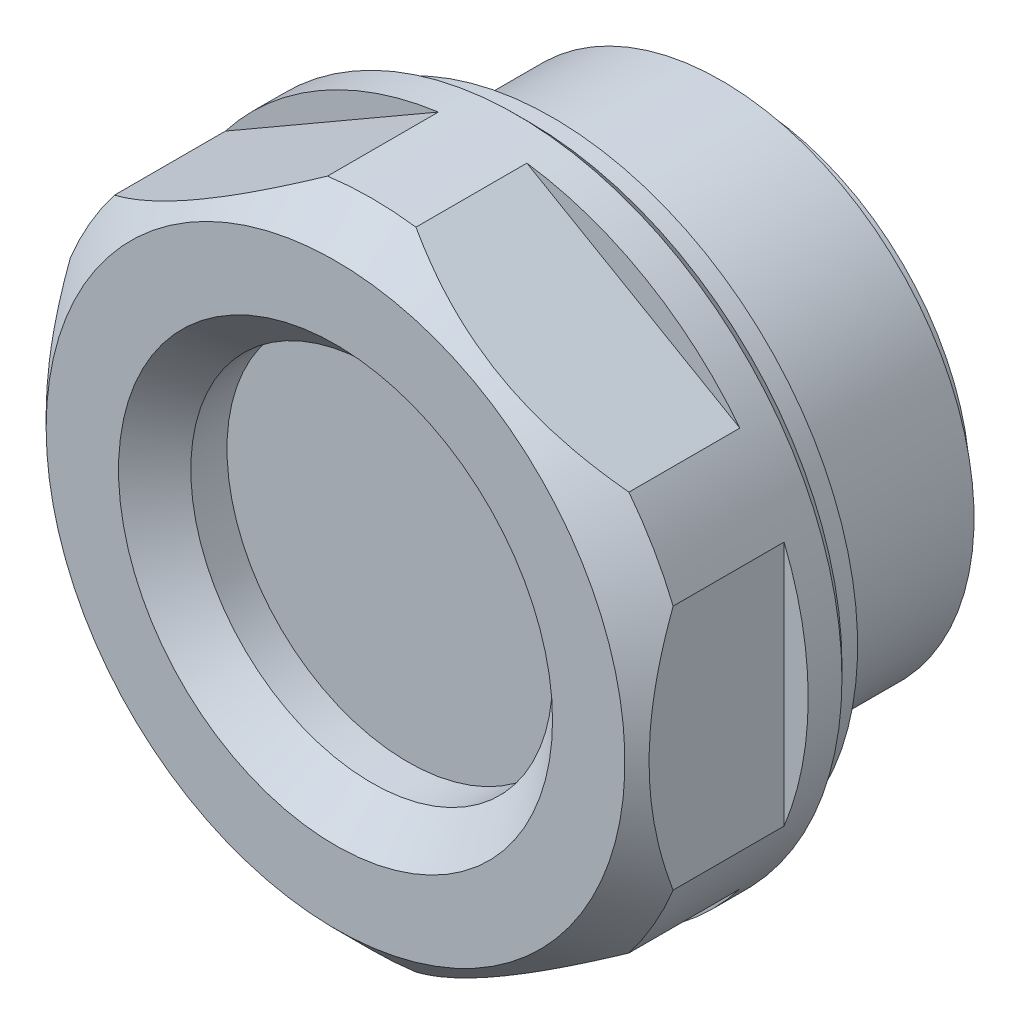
ISO-10303-21;
HEADER;
FILE_DESCRIPTION(('STEP AP214'),'2;1');
FILE_NAME('part.step','',(''),(''),'','','');
FILE_SCHEMA(('AUTOMOTIVE_DESIGN { 1 0 10303 214 1 1 1 1 }'));
ENDSEC;
DATA;
#1=APPLICATION_CONTEXT('core data for automotive mechanical design processes');
#2=APPLICATION_PROTOCOL_DEFINITION('international standard','automotive_design',2000,#1);
#3=PRODUCT_CONTEXT('',#1,'mechanical');
#4=PRODUCT('Part','Part','',(#3));
#5=PRODUCT_RELATED_PRODUCT_CATEGORY('part','',(#4));
#6=PRODUCT_DEFINITION_FORMATION('','',#4);
#7=PRODUCT_DEFINITION_CONTEXT('part definition',#1,'design');
#8=PRODUCT_DEFINITION('design','',#6,#7);
#9=PRODUCT_DEFINITION_SHAPE('','',#8);
#10=(LENGTH_UNIT() NAMED_UNIT(*) SI_UNIT(.MILLI.,.METRE.));
#11=(NAMED_UNIT(*) PLANE_ANGLE_UNIT() SI_UNIT($,.RADIAN.));
#12=(NAMED_UNIT(*) SI_UNIT($,.STERADIAN.) SOLID_ANGLE_UNIT());
#13=UNCERTAINTY_MEASURE_WITH_UNIT(LENGTH_MEASURE(1.E-05),#10,'distance_accuracy_value','');
#14=(GEOMETRIC_REPRESENTATION_CONTEXT(3) GLOBAL_UNCERTAINTY_ASSIGNED_CONTEXT((#13)) GLOBAL_UNIT_ASSIGNED_CONTEXT((#10,
#11,#12)) REPRESENTATION_CONTEXT('',''));
#15=CARTESIAN_POINT('',(0.,0.,0.));
#16=DIRECTION('',(0.,0.,1.));
#17=DIRECTION('',(1.,0.,0.));
#18=AXIS2_PLACEMENT_3D('',#15,#16,#17);
#19=CARTESIAN_POINT('',(-8.45677694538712E-13,-4.85722573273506E-13,7.5));
#20=DIRECTION('',(1.12757025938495E-13,0.,-1.));
#21=DIRECTION('',(-1.,0.,-1.12757025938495E-13));
#22=AXIS2_PLACEMENT_3D('',#19,#20,#21);
#23=CONICAL_SURFACE('',#22,13.5,0.78539816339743);
#24=CARTESIAN_POINT('',(-10.6660804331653,8.27569232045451,7.49991277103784));
#25=CARTESIAN_POINT('',(-10.4905943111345,8.37700928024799,7.57644782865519));
#26=CARTESIAN_POINT('',(-10.3139926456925,8.47897029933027,7.64956464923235));
#27=CARTESIAN_POINT('',(-9.95851789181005,8.68420374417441,7.78825873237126));
#28=CARTESIAN_POINT('',(-9.77964403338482,8.78747661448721,7.85383335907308));
#29=CARTESIAN_POINT('',(-9.23892063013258,9.09966341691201,8.0383908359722));
#30=CARTESIAN_POINT('',(-8.87376700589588,9.31048496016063,8.14485272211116));
#31=CARTESIAN_POINT('',(-8.14951864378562,9.72862994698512,8.31537622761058));
#32=CARTESIAN_POINT('',(-7.79067194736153,9.93581018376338,8.38081403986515));
#33=CARTESIAN_POINT('',(-7.24983830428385,10.2480606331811,8.44850810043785));
#34=CARTESIAN_POINT('',(-7.06921808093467,10.3523417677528,8.46599461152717));
#35=CARTESIAN_POINT('',(-6.70745476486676,10.5612059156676,8.49057927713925));
#36=CARTESIAN_POINT('',(-6.5263117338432,10.6657888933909,8.4976786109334));
#37=CARTESIAN_POINT('',(-6.15630803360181,10.8794106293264,8.50143364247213));
#38=CARTESIAN_POINT('',(-5.96744390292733,10.9884513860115,8.49763650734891));
#39=CARTESIAN_POINT('',(-5.59014251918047,11.2062864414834,8.47869087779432));
#40=CARTESIAN_POINT('',(-5.40170527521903,11.3150807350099,8.4635421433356));
#41=CARTESIAN_POINT('',(-5.02550053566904,11.5322826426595,8.42214651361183));
#42=CARTESIAN_POINT('',(-4.83773423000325,11.6406895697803,8.39588520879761));
#43=CARTESIAN_POINT('',(-4.46353816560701,11.8567317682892,8.33273814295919));
#44=CARTESIAN_POINT('',(-4.27710862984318,11.9643669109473,8.29585064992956));
#45=CARTESIAN_POINT('',(-3.70615459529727,12.2940073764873,8.1669143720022));
#46=CARTESIAN_POINT('',(-3.3243598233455,12.5144366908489,8.05822381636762));
#47=CARTESIAN_POINT('',(-2.7593850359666,12.8406250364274,7.86788171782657));
#48=CARTESIAN_POINT('',(-2.57256512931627,12.9484855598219,7.79998074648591));
#49=CARTESIAN_POINT('',(-2.20140446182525,13.1627752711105,7.65592899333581));
#50=CARTESIAN_POINT('',(-2.01706274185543,13.269205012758,7.57978151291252));
#51=CARTESIAN_POINT('',(-1.83391956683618,13.3749427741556,7.49991277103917));
#52=B_SPLINE_CURVE_WITH_KNOTS('',3,(#24,#25,#26,#27,#28,#29,#30,#31,#32,#33,#34,#35,#36,#37,#38,
#39,#40,#41,#42,#43,#44,#45,#46,#47,#48,#49,#50,#51),.UNSPECIFIED.,.F.,.F.,(4,2,2,2,2,2,2,2,2,2,
2,2,2,4),(0.,0.649767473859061,1.29976134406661,2.60270225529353,3.8591960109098,
4.48685708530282,5.11444689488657,5.76849079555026,6.42254852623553,7.07745697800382,
7.73247223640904,9.09240085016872,9.77074485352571,10.4488182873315),.UNSPECIFIED.);
#53=CARTESIAN_POINT('',(-10.6658804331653,8.27580779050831,7.49999999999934));
#54=VERTEX_POINT('',#53);
#55=CARTESIAN_POINT('',(-1.83411956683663,13.3748273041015,7.50000000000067));
#56=VERTEX_POINT('',#55);
#57=EDGE_CURVE('E168',#54,#56,#52,.T.);
#58=ORIENTED_EDGE('',*,*,#57,.F.);
#59=CARTESIAN_POINT('',(-8.45677694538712E-13,-4.85722573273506E-13,7.5));
#60=DIRECTION('',(1.12757025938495E-13,0.,-1.));
#61=DIRECTION('',(-1.,0.,-1.12757025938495E-13));
#62=AXIS2_PLACEMENT_3D('',#59,#60,#61);
#63=CIRCLE('',#62,13.5);
#64=CARTESIAN_POINT('',(-12.5000000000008,5.09901951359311,7.49999999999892));
#65=VERTEX_POINT('',#64);
#66=EDGE_CURVE('E149',#65,#54,#63,.T.);
#67=ORIENTED_EDGE('',*,*,#66,.F.);
#68=CARTESIAN_POINT('',(-12.5000000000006,-9.93363759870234,5.03356157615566));
#69=CARTESIAN_POINT('',(-12.5000000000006,-9.69388572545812,5.18270263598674));
#70=CARTESIAN_POINT('',(-12.5000000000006,-9.4526527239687,5.3294988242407));
#71=CARTESIAN_POINT('',(-12.5000000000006,-8.96688486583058,5.6176532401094));
#72=CARTESIAN_POINT('',(-12.5000000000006,-8.72234922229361,5.7590101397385));
#73=CARTESIAN_POINT('',(-12.5000000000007,-8.22868906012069,6.03606147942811));
#74=CARTESIAN_POINT('',(-12.5000000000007,-7.97954928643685,6.17172883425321));
#75=CARTESIAN_POINT('',(-12.5000000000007,-7.47745065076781,6.43577472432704));
#76=CARTESIAN_POINT('',(-12.5000000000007,-7.22449203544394,6.56415372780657));
#77=CARTESIAN_POINT('',(-12.5000000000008,-6.70890838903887,6.81523089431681));
#78=CARTESIAN_POINT('',(-12.5000000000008,-6.44619281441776,6.93774446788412));
#79=CARTESIAN_POINT('',(-12.5000000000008,-5.91627505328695,7.17264076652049));
#80=CARTESIAN_POINT('',(-12.5000000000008,-5.6490724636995,7.28502257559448));
#81=CARTESIAN_POINT('',(-12.5000000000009,-4.84136142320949,7.60430527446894));
#82=CARTESIAN_POINT('',(-12.5000000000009,-4.29368149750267,7.79387664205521));
#83=CARTESIAN_POINT('',(-12.5000000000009,-3.42588027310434,8.042471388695));
#84=CARTESIAN_POINT('',(-12.5000000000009,-3.11163501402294,8.12223899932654));
#85=CARTESIAN_POINT('',(-12.5000000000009,-2.47839187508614,8.26041530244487));
#86=CARTESIAN_POINT('',(-12.5000000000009,-2.15939376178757,8.31882294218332));
#87=CARTESIAN_POINT('',(-12.5000000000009,-1.52099028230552,8.41172481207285));
#88=CARTESIAN_POINT('',(-12.5000000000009,-1.20161743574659,8.44644045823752));
#89=CARTESIAN_POINT('',(-12.500000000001,-0.561137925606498,8.49149046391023));
#90=CARTESIAN_POINT('',(-12.500000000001,-0.240031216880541,8.50182418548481));
#91=CARTESIAN_POINT('',(-12.500000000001,0.460064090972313,8.49727374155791));
#92=CARTESIAN_POINT('',(-12.500000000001,0.839029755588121,8.47749664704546));
#93=CARTESIAN_POINT('',(-12.5000000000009,1.59372097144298,8.40441672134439));
#94=CARTESIAN_POINT('',(-12.5000000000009,1.96944584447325,8.35110703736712));
#95=CARTESIAN_POINT('',(-12.5000000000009,2.72005503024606,8.21286746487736));
#96=CARTESIAN_POINT('',(-12.5000000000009,3.09486366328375,8.12753196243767));
#97=CARTESIAN_POINT('',(-12.5000000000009,3.83693966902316,7.92926281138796));
#98=CARTESIAN_POINT('',(-12.5000000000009,4.20420823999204,7.81633358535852));
#99=CARTESIAN_POINT('',(-12.5000000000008,4.97853750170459,7.55058972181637));
#100=CARTESIAN_POINT('',(-12.5000000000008,5.38445787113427,7.39447901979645));
#101=CARTESIAN_POINT('',(-12.5000000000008,6.18610680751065,7.05778120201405));
#102=CARTESIAN_POINT('',(-12.5000000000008,6.58183066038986,6.87718299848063));
#103=CARTESIAN_POINT('',(-12.5000000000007,7.36488864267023,6.49571484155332));
#104=CARTESIAN_POINT('',(-12.5000000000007,7.75219158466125,6.29478136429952));
#105=CARTESIAN_POINT('',(-12.5000000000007,8.51801315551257,5.87705137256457));
#106=CARTESIAN_POINT('',(-12.5000000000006,8.89653310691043,5.66025726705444));
#107=CARTESIAN_POINT('',(-12.5000000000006,9.63022418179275,5.22317841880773));
#108=CARTESIAN_POINT('',(-12.5000000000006,9.98570976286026,5.00341878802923));
#109=CARTESIAN_POINT('',(-12.5000000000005,10.6905303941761,4.55421836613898));
#110=CARTESIAN_POINT('',(-12.5000000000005,11.0398649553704,4.3247768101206));
#111=CARTESIAN_POINT('',(-12.5000000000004,11.730360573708,3.85979522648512));
#112=CARTESIAN_POINT('',(-12.5000000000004,12.0715647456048,3.62431899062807));
#113=CARTESIAN_POINT('',(-12.5000000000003,12.7492291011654,3.14683194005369));
#114=CARTESIAN_POINT('',(-12.5000000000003,13.0856906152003,2.90482301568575));
#115=CARTESIAN_POINT('',(-12.5000000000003,13.4201576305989,2.66013547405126));
#116=B_SPLINE_CURVE_WITH_KNOTS('',3,(#68,#69,#70,#71,#72,#73,#74,#75,#76,#77,#78,#79,#80,#81,
#82,#83,#84,#85,#86,#87,#88,#89,#90,#91,#92,#93,#94,#95,#96,#97,#98,#99,#100,#101,#102,#103,
#104,#105,#106,#107,#108,#109,#110,#111,#112,#113,#114,#115),.UNSPECIFIED.,.F.,.F.,(4,2,2,2,2,2,
2,2,2,2,2,2,2,2,2,2,2,2,2,2,2,2,2,4),(0.,0.84707776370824,1.69436104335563,2.54530278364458,
3.39618979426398,4.26560624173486,5.13510121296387,6.87051887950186,7.84255063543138,
8.81463029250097,9.77749608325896,10.7403870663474,11.8772270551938,13.0142994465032,
14.1662877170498,15.3180914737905,16.6218041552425,17.9261091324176,19.234622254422,
20.5429370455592,21.7965393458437,23.0502408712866,24.2938717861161,25.5371466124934),.UNSPECIFIED.);
#117=CARTESIAN_POINT('',(-12.5000000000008,-5.0990195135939,7.49999999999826));
#118=VERTEX_POINT('',#117);
#119=EDGE_CURVE('E108',#65,#118,#116,.F.);
#120=ORIENTED_EDGE('',*,*,#119,.T.);
#121=CARTESIAN_POINT('',(-10.6658804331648,-8.2758077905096,7.49999999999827));
#122=VERTEX_POINT('',#121);
#123=EDGE_CURVE('E152',#122,#118,#63,.T.);
#124=ORIENTED_EDGE('',*,*,#123,.F.);
#125=CARTESIAN_POINT('',(-1.83391956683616,-13.3749427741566,7.49991277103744));
#126=CARTESIAN_POINT('',(-2.00940568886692,-13.2736258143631,7.57644782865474));
#127=CARTESIAN_POINT('',(-2.18600735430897,-13.1716647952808,7.64956464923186));
#128=CARTESIAN_POINT('',(-2.54148210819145,-12.9664313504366,7.78825873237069));
#129=CARTESIAN_POINT('',(-2.7203559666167,-12.8631584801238,7.85383335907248));
#130=CARTESIAN_POINT('',(-3.26107936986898,-12.550971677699,8.03839083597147));
#131=CARTESIAN_POINT('',(-3.6262329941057,-12.3401501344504,8.14485272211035));
#132=CARTESIAN_POINT('',(-4.350481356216,-11.9220051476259,8.31537622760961));
#133=CARTESIAN_POINT('',(-4.7093280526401,-11.7148249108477,8.3808140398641));
#134=CARTESIAN_POINT('',(-5.25016169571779,-11.4025744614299,8.44850810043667));
#135=CARTESIAN_POINT('',(-5.43078191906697,-11.2982933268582,8.46599461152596));
#136=CARTESIAN_POINT('',(-5.79254523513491,-11.0894291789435,8.49057927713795));
#137=CARTESIAN_POINT('',(-5.9736882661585,-10.9848462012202,8.49767861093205));
#138=CARTESIAN_POINT('',(-6.3436919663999,-10.7712244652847,8.5014336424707));
#139=CARTESIAN_POINT('',(-6.53255609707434,-10.6621837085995,8.49763650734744));
#140=CARTESIAN_POINT('',(-6.90985748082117,-10.4443486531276,8.47869087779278));
#141=CARTESIAN_POINT('',(-7.09829472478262,-10.3355543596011,8.46354214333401));
#142=CARTESIAN_POINT('',(-7.4744994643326,-10.1183524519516,8.42214651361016));
#143=CARTESIAN_POINT('',(-7.66226576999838,-10.0099455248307,8.39588520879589));
#144=CARTESIAN_POINT('',(-8.03646183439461,-9.79390332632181,8.33273814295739));
#145=CARTESIAN_POINT('',(-8.22289137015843,-9.68626818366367,8.29585064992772));
#146=CARTESIAN_POINT('',(-8.79384540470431,-9.35662771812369,8.16691437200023));
#147=CARTESIAN_POINT('',(-9.17564017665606,-9.13619840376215,8.05822381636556));
#148=CARTESIAN_POINT('',(-9.74061496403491,-8.81001005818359,7.8678817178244));
#149=CARTESIAN_POINT('',(-9.92743487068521,-8.70214953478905,7.79998074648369));
#150=CARTESIAN_POINT('',(-10.2985955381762,-8.48785982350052,7.65592899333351));
#151=CARTESIAN_POINT('',(-10.482937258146,-8.38143008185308,7.57978151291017));
#152=CARTESIAN_POINT('',(-10.6660804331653,-8.2756923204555,7.49991277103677));
#153=B_SPLINE_CURVE_WITH_KNOTS('',3,(#125,#126,#127,#128,#129,#130,#131,#132,#133,#134,#135,
#136,#137,#138,#139,#140,#141,#142,#143,#144,#145,#146,#147,#148,#149,#150,#151,#152),
.UNSPECIFIED.,.F.,.F.,(4,2,2,2,2,2,2,2,2,2,2,2,2,4),(0.,0.649767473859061,1.29976134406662,
2.60270225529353,3.8591960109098,4.48685708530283,5.11444689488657,5.76849079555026,
6.42254852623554,7.07745697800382,7.73247223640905,9.09240085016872,9.77074485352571,
10.4488182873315),.UNSPECIFIED.);
#154=CARTESIAN_POINT('',(-1.83411956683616,-13.3748273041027,7.49999999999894));
#155=VERTEX_POINT('',#154);
#156=EDGE_CURVE('E246',#155,#122,#153,.T.);
#157=ORIENTED_EDGE('',*,*,#156,.F.);
#158=CARTESIAN_POINT('',(1.83411956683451,-13.3748273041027,7.49999999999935));
#159=VERTEX_POINT('',#158);
#160=EDGE_CURVE('E300',#159,#155,#63,.T.);
#161=ORIENTED_EDGE('',*,*,#160,.F.);
#162=CARTESIAN_POINT('',(1.83391956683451,-13.3749427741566,7.49991277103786));
#163=CARTESIAN_POINT('',(2.00940568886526,-13.2736258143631,7.57644782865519));
#164=CARTESIAN_POINT('',(2.18600735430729,-13.1716647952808,7.64956464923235));
#165=CARTESIAN_POINT('',(2.54148210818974,-12.9664313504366,7.78825873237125));
#166=CARTESIAN_POINT('',(2.72035596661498,-12.8631584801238,7.85383335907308));
#167=CARTESIAN_POINT('',(3.26107936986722,-12.550971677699,8.0383908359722));
#168=CARTESIAN_POINT('',(3.62623299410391,-12.3401501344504,8.14485272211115));
#169=CARTESIAN_POINT('',(4.35048135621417,-11.9220051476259,8.31537622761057));
#170=CARTESIAN_POINT('',(4.70932805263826,-11.7148249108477,8.38081403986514));
#171=CARTESIAN_POINT('',(5.25016169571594,-11.4025744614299,8.44850810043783));
#172=CARTESIAN_POINT('',(5.43078191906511,-11.2982933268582,8.46599461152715));
#173=CARTESIAN_POINT('',(5.79254523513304,-11.0894291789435,8.49057927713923));
#174=CARTESIAN_POINT('',(5.97368826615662,-10.9848462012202,8.4976786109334));
#175=CARTESIAN_POINT('',(6.34369196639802,-10.7712244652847,8.50143364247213));
#176=CARTESIAN_POINT('',(6.53255609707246,-10.6621837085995,8.49763650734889));
#177=CARTESIAN_POINT('',(6.9098574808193,-10.4443486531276,8.4786908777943));
#178=CARTESIAN_POINT('',(7.09829472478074,-10.3355543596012,8.46354214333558));
#179=CARTESIAN_POINT('',(7.47449946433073,-10.1183524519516,8.42214651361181));
#180=CARTESIAN_POINT('',(7.66226576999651,-10.0099455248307,8.39588520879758));
#181=CARTESIAN_POINT('',(8.03646183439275,-9.79390332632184,8.33273814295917));
#182=CARTESIAN_POINT('',(8.22289137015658,-9.6862681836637,8.29585064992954));
#183=CARTESIAN_POINT('',(8.79384540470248,-9.35662771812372,8.16691437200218));
#184=CARTESIAN_POINT('',(9.17564017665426,-9.13619840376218,8.0582238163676));
#185=CARTESIAN_POINT('',(9.74061496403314,-8.81001005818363,7.86788171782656));
#186=CARTESIAN_POINT('',(9.92743487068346,-8.70214953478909,7.79998074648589));
#187=CARTESIAN_POINT('',(10.2985955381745,-8.48785982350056,7.6559289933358));
#188=CARTESIAN_POINT('',(10.4829372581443,-8.38143008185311,7.57978151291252));
#189=CARTESIAN_POINT('',(10.6660804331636,-8.2756923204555,7.49991277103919));
#190=B_SPLINE_CURVE_WITH_KNOTS('',3,(#162,#163,#164,#165,#166,#167,#168,#169,#170,#171,#172,
#173,#174,#175,#176,#177,#178,#179,#180,#181,#182,#183,#184,#185,#186,#187,#188,#189),
.UNSPECIFIED.,.F.,.F.,(4,2,2,2,2,2,2,2,2,2,2,2,2,4),(0.,0.649767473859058,1.29976134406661,
2.60270225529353,3.85919601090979,4.48685708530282,5.11444689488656,5.76849079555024,
6.4225485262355,7.07745697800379,7.732472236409,9.09240085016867,9.77074485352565,
10.4488182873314),.UNSPECIFIED.);
#191=CARTESIAN_POINT('',(10.6658804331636,-8.2758077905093,7.50000000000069));
#192=VERTEX_POINT('',#191);
#193=EDGE_CURVE('E277',#159,#192,#190,.T.);
#194=ORIENTED_EDGE('',*,*,#193,.T.);
#195=CARTESIAN_POINT('',(12.4999999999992,-5.0990195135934,7.50000000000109));
#196=VERTEX_POINT('',#195);
#197=EDGE_CURVE('E297',#196,#192,#63,.T.);
#198=ORIENTED_EDGE('',*,*,#197,.F.);
#199=CARTESIAN_POINT('',(12.4999999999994,-9.93363759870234,5.03356157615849));
#200=CARTESIAN_POINT('',(12.4999999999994,-9.69388572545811,5.18270263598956));
#201=CARTESIAN_POINT('',(12.4999999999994,-9.45265272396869,5.32949882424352));
#202=CARTESIAN_POINT('',(12.4999999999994,-8.96688486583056,5.61765324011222));
#203=CARTESIAN_POINT('',(12.4999999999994,-8.72234922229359,5.75901013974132));
#204=CARTESIAN_POINT('',(12.4999999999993,-8.22868906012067,6.03606147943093));
#205=CARTESIAN_POINT('',(12.4999999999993,-7.97954928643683,6.17172883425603));
#206=CARTESIAN_POINT('',(12.4999999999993,-7.47745065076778,6.43577472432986));
#207=CARTESIAN_POINT('',(12.4999999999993,-7.22449203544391,6.5641537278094));
#208=CARTESIAN_POINT('',(12.4999999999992,-6.70890838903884,6.81523089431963));
#209=CARTESIAN_POINT('',(12.4999999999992,-6.44619281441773,6.93774446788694));
#210=CARTESIAN_POINT('',(12.4999999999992,-5.91627505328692,7.17264076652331));
#211=CARTESIAN_POINT('',(12.4999999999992,-5.64907246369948,7.28502257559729));
#212=CARTESIAN_POINT('',(12.4999999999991,-4.84136142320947,7.60430527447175));
#213=CARTESIAN_POINT('',(12.4999999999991,-4.29368149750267,7.79387664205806));
#214=CARTESIAN_POINT('',(12.4999999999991,-3.42588027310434,8.04247138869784));
#215=CARTESIAN_POINT('',(12.4999999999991,-3.11163501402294,8.12223899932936));
#216=CARTESIAN_POINT('',(12.4999999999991,-2.47839187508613,8.26041530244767));
#217=CARTESIAN_POINT('',(12.4999999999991,-2.15939376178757,8.31882294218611));
#218=CARTESIAN_POINT('',(12.4999999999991,-1.52099028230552,8.41172481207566));
#219=CARTESIAN_POINT('',(12.4999999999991,-1.20161743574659,8.44644045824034));
#220=CARTESIAN_POINT('',(12.499999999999,-0.561137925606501,8.49149046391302));
#221=CARTESIAN_POINT('',(12.499999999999,-0.240031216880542,8.50182418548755));
#222=CARTESIAN_POINT('',(12.499999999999,0.460064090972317,8.49727374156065));
#223=CARTESIAN_POINT('',(12.499999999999,0.83902975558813,8.47749664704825));
#224=CARTESIAN_POINT('',(12.4999999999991,1.593720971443,8.40441672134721));
#225=CARTESIAN_POINT('',(12.4999999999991,1.96944584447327,8.35110703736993));
#226=CARTESIAN_POINT('',(12.4999999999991,2.72005503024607,8.21286746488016));
#227=CARTESIAN_POINT('',(12.4999999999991,3.09486366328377,8.12753196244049));
#228=CARTESIAN_POINT('',(12.4999999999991,3.83693966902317,7.92926281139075));
#229=CARTESIAN_POINT('',(12.4999999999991,4.20420823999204,7.81633358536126));
#230=CARTESIAN_POINT('',(12.4999999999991,4.97853750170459,7.5505897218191));
#231=CARTESIAN_POINT('',(12.4999999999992,5.38445787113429,7.39447901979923));
#232=CARTESIAN_POINT('',(12.4999999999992,6.18610680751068,7.05778120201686));
#233=CARTESIAN_POINT('',(12.4999999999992,6.58183066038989,6.87718299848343));
#234=CARTESIAN_POINT('',(12.4999999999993,7.36488864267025,6.49571484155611));
#235=CARTESIAN_POINT('',(12.4999999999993,7.75219158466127,6.29478136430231));
#236=CARTESIAN_POINT('',(12.4999999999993,8.51801315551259,5.87705137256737));
#237=CARTESIAN_POINT('',(12.4999999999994,8.89653310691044,5.66025726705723));
#238=CARTESIAN_POINT('',(12.4999999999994,9.63022418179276,5.22317841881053));
#239=CARTESIAN_POINT('',(12.4999999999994,9.98570976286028,5.00341878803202));
#240=CARTESIAN_POINT('',(12.4999999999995,10.6905303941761,4.55421836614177));
#241=CARTESIAN_POINT('',(12.4999999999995,11.0398649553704,4.32477681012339));
#242=CARTESIAN_POINT('',(12.4999999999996,11.730360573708,3.8597952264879));
#243=CARTESIAN_POINT('',(12.4999999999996,12.0715647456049,3.62431899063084));
#244=CARTESIAN_POINT('',(12.4999999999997,12.7492291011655,3.14683194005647));
#245=CARTESIAN_POINT('',(12.4999999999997,13.0856906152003,2.90482301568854));
#246=CARTESIAN_POINT('',(12.4999999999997,13.420157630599,2.6601354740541));
#247=B_SPLINE_CURVE_WITH_KNOTS('',3,(#199,#200,#201,#202,#203,#204,#205,#206,#207,#208,#209,
#210,#211,#212,#213,#214,#215,#216,#217,#218,#219,#220,#221,#222,#223,#224,#225,#226,#227,#228,
#229,#230,#231,#232,#233,#234,#235,#236,#237,#238,#239,#240,#241,#242,#243,#244,#245,#246),
.UNSPECIFIED.,.F.,.F.,(4,2,2,2,2,2,2,2,2,2,2,2,2,2,2,2,2,2,2,2,2,2,2,4),(0.,0.847077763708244,
1.69436104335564,2.5453027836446,3.396189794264,4.26560624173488,5.13510121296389,
6.87051887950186,7.84255063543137,8.81463029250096,9.77749608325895,10.7403870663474,
11.8772270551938,13.0142994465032,14.1662877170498,15.3180914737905,16.6218041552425,
17.9261091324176,19.234622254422,20.5429370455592,21.7965393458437,23.0502408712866,
24.2938717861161,25.5371466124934),.UNSPECIFIED.);
#248=CARTESIAN_POINT('',(12.4999999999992,5.099019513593,7.50000000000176));
#249=VERTEX_POINT('',#248);
#250=EDGE_CURVE('E283',#249,#196,#247,.F.);
#251=ORIENTED_EDGE('',*,*,#250,.F.);
#252=CARTESIAN_POINT('',(10.6658804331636,8.27580779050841,7.50000000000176));
#253=VERTEX_POINT('',#252);
#254=EDGE_CURVE('E293',#253,#249,#63,.T.);
#255=ORIENTED_EDGE('',*,*,#254,.F.);
#256=CARTESIAN_POINT('',(10.6660804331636,8.27569232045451,7.49991277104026));
#257=CARTESIAN_POINT('',(10.4905943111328,8.37700928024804,7.57644782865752));
#258=CARTESIAN_POINT('',(10.3139926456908,8.47897029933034,7.64956464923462));
#259=CARTESIAN_POINT('',(9.95851789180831,8.6842037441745,7.78825873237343));
#260=CARTESIAN_POINT('',(9.77964403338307,8.78747661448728,7.85383335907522));
#261=CARTESIAN_POINT('',(9.23892063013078,9.09966341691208,8.03839083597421));
#262=CARTESIAN_POINT('',(8.87376700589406,9.31048496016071,8.14485272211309));
#263=CARTESIAN_POINT('',(8.14951864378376,9.7286299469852,8.31537622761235));
#264=CARTESIAN_POINT('',(7.79067194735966,9.93581018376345,8.38081403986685));
#265=CARTESIAN_POINT('',(7.24983830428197,10.2480606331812,8.44850810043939));
#266=CARTESIAN_POINT('',(7.06921808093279,10.3523417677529,8.46599461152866));
#267=CARTESIAN_POINT('',(6.70745476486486,10.5612059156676,8.4905792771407));
#268=CARTESIAN_POINT('',(6.52631173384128,10.6657888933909,8.49767861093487));
#269=CARTESIAN_POINT('',(6.15630803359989,10.8794106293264,8.50143364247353));
#270=CARTESIAN_POINT('',(5.96744390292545,10.9884513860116,8.49763650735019));
#271=CARTESIAN_POINT('',(5.59014251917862,11.2062864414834,8.47869087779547));
#272=CARTESIAN_POINT('',(5.40170527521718,11.3150807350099,8.46354214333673));
#273=CARTESIAN_POINT('',(5.02550053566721,11.5322826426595,8.42214651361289));
#274=CARTESIAN_POINT('',(4.83773423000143,11.6406895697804,8.39588520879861));
#275=CARTESIAN_POINT('',(4.4635381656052,11.8567317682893,8.33273814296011));
#276=CARTESIAN_POINT('',(4.27710862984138,11.9643669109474,8.29585064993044));
#277=CARTESIAN_POINT('',(3.7061545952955,12.2940073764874,8.16691437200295));
#278=CARTESIAN_POINT('',(3.32435982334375,12.5144366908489,8.05822381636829));
#279=CARTESIAN_POINT('',(2.75938503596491,12.8406250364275,7.86788171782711));
#280=CARTESIAN_POINT('',(2.5725651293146,12.948485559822,7.7999807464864));
#281=CARTESIAN_POINT('',(2.20140446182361,13.1627752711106,7.65592899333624));
#282=CARTESIAN_POINT('',(2.0170627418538,13.269205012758,7.57978151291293));
#283=CARTESIAN_POINT('',(1.83391956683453,13.3749427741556,7.49991277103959));
#284=B_SPLINE_CURVE_WITH_KNOTS('',3,(#256,#257,#258,#259,#260,#261,#262,#263,#264,#265,#266,
#267,#268,#269,#270,#271,#272,#273,#274,#275,#276,#277,#278,#279,#280,#281,#282,#283),
.UNSPECIFIED.,.F.,.F.,(4,2,2,2,2,2,2,2,2,2,2,2,2,4),(0.,0.649767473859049,1.29976134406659,
2.60270225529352,3.85919601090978,4.48685708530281,5.11444689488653,5.76849079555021,
6.42254852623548,7.07745697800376,7.73247223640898,9.09240085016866,9.77074485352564,
10.4488182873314),.UNSPECIFIED.);
#285=CARTESIAN_POINT('',(1.83411956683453,13.3748273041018,7.50000000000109));
#286=VERTEX_POINT('',#285);
#287=EDGE_CURVE('E176',#253,#286,#284,.T.);
#288=ORIENTED_EDGE('',*,*,#287,.T.);
#289=EDGE_CURVE('E151',#56,#286,#63,.T.);
#290=ORIENTED_EDGE('',*,*,#289,.F.);
#291=EDGE_LOOP('',(#58,#67,#120,#124,#157,#161,#194,#198,#251,#255,#288,#290));
#292=FACE_BOUND('',#291,.T.);
#293=CARTESIAN_POINT('',(-1.01481323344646E-12,-5.82867087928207E-13,9.));
#294=DIRECTION('',(1.12757025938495E-13,0.,-1.));
#295=DIRECTION('',(-1.,0.,-1.12757025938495E-13));
#296=AXIS2_PLACEMENT_3D('',#293,#294,#295);
#297=CIRCLE('',#296,12.);
#298=CARTESIAN_POINT('',(-12.000000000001,-5.82867087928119E-13,8.99999999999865));
#299=VERTEX_POINT('',#298);
#300=EDGE_CURVE('E146',#299,#299,#297,.T.);
#301=ORIENTED_EDGE('',*,*,#300,.T.);
#302=EDGE_LOOP('',(#301));
#303=FACE_BOUND('',#302,.T.);
#304=ADVANCED_FACE('F14',(#292,#303),#23,.T.);
#305=CARTESIAN_POINT('',(-1.12757025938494E-13,12.65,1.00000000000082));
#306=DIRECTION('',(1.12757025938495E-13,0.,-1.));
#307=DIRECTION('',(-1.,0.,-1.12757025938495E-13));
#308=AXIS2_PLACEMENT_3D('',#305,#306,#307);
#309=PLANE('',#308);
#310=CARTESIAN_POINT('',(-1.12757025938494E-13,0.,1.));
#311=DIRECTION('',(1.12757025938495E-13,0.,-1.));
#312=DIRECTION('',(-1.,0.,-1.12757025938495E-13));
#313=AXIS2_PLACEMENT_3D('',#310,#311,#312);
#314=CIRCLE('',#313,13.);
#315=CARTESIAN_POINT('',(-13.0000000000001,0.,0.999999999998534));
#316=VERTEX_POINT('',#315);
#317=EDGE_CURVE('E156',#316,#316,#314,.T.);
#318=ORIENTED_EDGE('',*,*,#317,.T.);
#319=EDGE_LOOP('',(#318));
#320=FACE_BOUND('',#319,.T.);
#321=CARTESIAN_POINT('',(-1.12757025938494E-13,0.,1.));
#322=DIRECTION('',(1.12757025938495E-13,0.,-1.));
#323=DIRECTION('',(-1.,0.,-1.12757025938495E-13));
#324=AXIS2_PLACEMENT_3D('',#321,#322,#323);
#325=CIRCLE('',#324,12.65);
#326=CARTESIAN_POINT('',(-12.6500000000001,0.,0.999999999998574));
#327=VERTEX_POINT('',#326);
#328=EDGE_CURVE('E125',#327,#327,#325,.T.);
#329=ORIENTED_EDGE('',*,*,#328,.F.);
#330=EDGE_LOOP('',(#329));
#331=FACE_BOUND('',#330,.T.);
#332=ADVANCED_FACE('F16',(#320,#331),#309,.T.);
#333=CARTESIAN_POINT('',(1.31579113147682E-12,7.49400541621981E-13,-11.669260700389));
#334=DIRECTION('',(1.12757025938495E-13,0.,-1.));
#335=DIRECTION('',(-1.,0.,-1.12757025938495E-13));
#336=AXIS2_PLACEMENT_3D('',#333,#334,#335);
#337=CYLINDRICAL_SURFACE('',#336,12.65);
#338=CARTESIAN_POINT('',(0.,0.,0.));
#339=DIRECTION('',(1.12757025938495E-13,0.,-1.));
#340=DIRECTION('',(-1.,0.,-1.12757025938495E-13));
#341=AXIS2_PLACEMENT_3D('',#338,#339,#340);
#342=CIRCLE('',#341,12.65);
#343=CARTESIAN_POINT('',(-12.65,0.,-1.42637637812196E-12));
#344=VERTEX_POINT('',#343);
#345=EDGE_CURVE('E128',#344,#344,#342,.T.);
#346=ORIENTED_EDGE('',*,*,#345,.F.);
#347=EDGE_LOOP('',(#346));
#348=FACE_BOUND('',#347,.T.);
#349=ORIENTED_EDGE('',*,*,#328,.T.);
#350=EDGE_LOOP('',(#349));
#351=FACE_BOUND('',#350,.T.);
#352=ADVANCED_FACE('F230',(#348,#351),#337,.T.);
#353=CARTESIAN_POINT('',(0.,10.4775,6.80011602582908E-13));
#354=DIRECTION('',(1.12757025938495E-13,0.,-1.));
#355=DIRECTION('',(-1.,0.,-1.12757025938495E-13));
#356=AXIS2_PLACEMENT_3D('',#353,#354,#355);
#357=PLANE('',#356);
#358=ORIENTED_EDGE('',*,*,#345,.T.);
#359=EDGE_LOOP('',(#358));
#360=FACE_BOUND('',#359,.T.);
#361=CARTESIAN_POINT('',(0.,0.,0.));
#362=DIRECTION('',(1.12757025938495E-13,0.,-1.));
#363=DIRECTION('',(-1.,0.,-1.12757025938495E-13));
#364=AXIS2_PLACEMENT_3D('',#361,#362,#363);
#365=CIRCLE('',#364,10.4775);
#366=CARTESIAN_POINT('',(-10.4775,0.,-1.18141173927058E-12));
#367=VERTEX_POINT('',#366);
#368=EDGE_CURVE('E132',#367,#367,#365,.T.);
#369=ORIENTED_EDGE('',*,*,#368,.F.);
#370=EDGE_LOOP('',(#369));
#371=FACE_BOUND('',#370,.T.);
#372=ADVANCED_FACE('F480',(#360,#371),#357,.T.);
#373=CARTESIAN_POINT('',(1.31579113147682E-12,7.49400541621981E-13,-11.669260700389));
#374=DIRECTION('',(1.12757025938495E-13,0.,-1.));
#375=DIRECTION('',(-1.,0.,-1.12757025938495E-13));
#376=AXIS2_PLACEMENT_3D('',#373,#374,#375);
#377=CYLINDRICAL_SURFACE('',#376,10.4775);
#378=CARTESIAN_POINT('',(7.89299181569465E-13,4.44089209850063E-13,-7.));
#379=DIRECTION('',(1.12757025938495E-13,0.,-1.));
#380=DIRECTION('',(-1.,0.,-1.12757025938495E-13));
#381=AXIS2_PLACEMENT_3D('',#378,#379,#380);
#382=CIRCLE('',#381,10.4775);
#383=CARTESIAN_POINT('',(-10.4774999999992,4.44089209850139E-13,-7.00000000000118));
#384=VERTEX_POINT('',#383);
#385=EDGE_CURVE('E137',#384,#384,#382,.T.);
#386=ORIENTED_EDGE('',*,*,#385,.F.);
#387=EDGE_LOOP('',(#386));
#388=FACE_BOUND('',#387,.T.);
#389=ORIENTED_EDGE('',*,*,#368,.T.);
#390=EDGE_LOOP('',(#389));
#391=FACE_BOUND('',#390,.T.);
#392=ADVANCED_FACE('F487',(#388,#391),#377,.T.);
#393=CARTESIAN_POINT('',(7.89299181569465E-13,10.4775000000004,-6.99999999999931));
#394=DIRECTION('',(-1.12757025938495E-13,0.,1.));
#395=DIRECTION('',(1.,0.,1.12757025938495E-13));
#396=AXIS2_PLACEMENT_3D('',#393,#394,#395);
#397=PLANE('',#396);
#398=CARTESIAN_POINT('',(7.89299181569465E-13,4.44089209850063E-13,-7.));
#399=DIRECTION('',(1.12757025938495E-13,0.,-1.));
#400=DIRECTION('',(-1.,0.,-1.12757025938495E-13));
#401=AXIS2_PLACEMENT_3D('',#398,#399,#400);
#402=CIRCLE('',#401,9.3155);
#403=CARTESIAN_POINT('',(-9.31549999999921,4.44089209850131E-13,-7.00000000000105));
#404=VERTEX_POINT('',#403);
#405=EDGE_CURVE('E140',#404,#404,#402,.T.);
#406=ORIENTED_EDGE('',*,*,#405,.F.);
#407=EDGE_LOOP('',(#406));
#408=FACE_BOUND('',#407,.T.);
#409=ORIENTED_EDGE('',*,*,#385,.T.);
#410=EDGE_LOOP('',(#409));
#411=FACE_BOUND('',#410,.T.);
#412=ADVANCED_FACE('F496',(#408,#411),#397,.F.);
#413=CARTESIAN_POINT('',(1.31579113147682E-12,7.49400541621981E-13,-11.669260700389));
#414=DIRECTION('',(1.12757025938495E-13,0.,-1.));
#415=DIRECTION('',(-1.,0.,-1.12757025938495E-13));
#416=AXIS2_PLACEMENT_3D('',#413,#414,#415);
#417=CYLINDRICAL_SURFACE('',#416,9.3155);
#418=CARTESIAN_POINT('',(9.0205620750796E-13,5.13478148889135E-13,-8.));
#419=DIRECTION('',(1.12757025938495E-13,0.,-1.));
#420=DIRECTION('',(-1.,0.,-1.12757025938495E-13));
#421=AXIS2_PLACEMENT_3D('',#418,#419,#420);
#422=CIRCLE('',#421,9.3155);
#423=CARTESIAN_POINT('',(-9.3154999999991,5.13478148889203E-13,-8.00000000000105));
#424=VERTEX_POINT('',#423);
#425=EDGE_CURVE('E143',#424,#424,#422,.T.);
#426=ORIENTED_EDGE('',*,*,#425,.F.);
#427=EDGE_LOOP('',(#426));
#428=FACE_BOUND('',#427,.T.);
#429=ORIENTED_EDGE('',*,*,#405,.T.);
#430=EDGE_LOOP('',(#429));
#431=FACE_BOUND('',#430,.T.);
#432=ADVANCED_FACE('F505',(#428,#431),#417,.T.);
#433=CARTESIAN_POINT('',(9.0205620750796E-13,9.3155000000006,-7.99999999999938));
#434=DIRECTION('',(-1.12757025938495E-13,0.,1.));
#435=DIRECTION('',(1.,0.,1.12757025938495E-13));
#436=AXIS2_PLACEMENT_3D('',#433,#434,#435);
#437=PLANE('',#436);
#438=ORIENTED_EDGE('',*,*,#425,.T.);
#439=EDGE_LOOP('',(#438));
#440=FACE_BOUND('',#439,.T.);
#441=ADVANCED_FACE('F222',(#440),#437,.F.);
#442=CARTESIAN_POINT('',(-1.01481323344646E-12,11.9999999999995,9.00000000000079));
#443=DIRECTION('',(-1.12757025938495E-13,0.,1.));
#444=DIRECTION('',(1.,0.,1.12757025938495E-13));
#445=AXIS2_PLACEMENT_3D('',#442,#443,#444);
#446=PLANE('',#445);
#447=CARTESIAN_POINT('',(-1.01481323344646E-12,-5.82867087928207E-13,9.));
#448=DIRECTION('',(-1.12757025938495E-13,0.,1.));
#449=DIRECTION('',(1.,0.,1.12757025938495E-13));
#450=AXIS2_PLACEMENT_3D('',#447,#448,#449);
#451=CIRCLE('',#450,8.99852359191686);
#452=CARTESIAN_POINT('',(8.99852359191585,-5.82867087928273E-13,9.00000000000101));
#453=VERTEX_POINT('',#452);
#454=EDGE_CURVE('E159',#453,#453,#451,.T.);
#455=ORIENTED_EDGE('',*,*,#454,.F.);
#456=EDGE_LOOP('',(#455));
#457=FACE_BOUND('',#456,.T.);
#458=ORIENTED_EDGE('',*,*,#300,.F.);
#459=EDGE_LOOP('',(#458));
#460=FACE_BOUND('',#459,.T.);
#461=ADVANCED_FACE('F216',(#457,#460),#446,.T.);
#462=CARTESIAN_POINT('',(1.31579113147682E-12,7.49400541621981E-13,-11.669260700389));
#463=DIRECTION('',(1.12757025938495E-13,0.,-1.));
#464=DIRECTION('',(-1.,0.,-1.12757025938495E-13));
#465=AXIS2_PLACEMENT_3D('',#462,#463,#464);
#466=CYLINDRICAL_SURFACE('',#465,13.5);
#467=DIRECTION('',(-1.12757025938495E-13,0.,1.));
#468=VECTOR('',#467,1.);
#469=CARTESIAN_POINT('',(-12.5000000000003,-5.0990195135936,2.89999999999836));
#470=LINE('',#469,#468);
#471=CARTESIAN_POINT('',(-12.5000000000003,-5.0990195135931,2.89999999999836));
#472=VERTEX_POINT('',#471);
#473=EDGE_CURVE('E113',#472,#118,#470,.T.);
#474=ORIENTED_EDGE('',*,*,#473,.F.);
#475=CARTESIAN_POINT('',(-3.26995375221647E-13,-1.94289029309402E-13,2.90000000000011));
#476=DIRECTION('',(-1.12757025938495E-13,0.,1.));
#477=DIRECTION('',(1.,0.,1.12757025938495E-13));
#478=AXIS2_PLACEMENT_3D('',#475,#476,#477);
#479=CIRCLE('',#478,13.5);
#480=CARTESIAN_POINT('',(-12.5000000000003,5.0990195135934,2.89999999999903));
#481=VERTEX_POINT('',#480);
#482=EDGE_CURVE('E23',#481,#472,#479,.T.);
#483=ORIENTED_EDGE('',*,*,#482,.F.);
#484=DIRECTION('',(-1.12757025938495E-13,0.,1.));
#485=VECTOR('',#484,1.);
#486=CARTESIAN_POINT('',(-12.5000000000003,5.0990195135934,2.89999999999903));
#487=LINE('',#486,#485);
#488=EDGE_CURVE('E102',#481,#65,#487,.T.);
#489=ORIENTED_EDGE('',*,*,#488,.T.);
#490=ORIENTED_EDGE('',*,*,#66,.T.);
#491=DIRECTION('',(-1.12757025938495E-13,0.,1.));
#492=VECTOR('',#491,1.);
#493=CARTESIAN_POINT('',(-10.6658804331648,8.2758077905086,2.89999999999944));
#494=LINE('',#493,#492);
#495=CARTESIAN_POINT('',(-10.6658804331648,8.2758077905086,2.89999999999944));
#496=VERTEX_POINT('',#495);
#497=EDGE_CURVE('E242',#496,#54,#494,.T.);
#498=ORIENTED_EDGE('',*,*,#497,.F.);
#499=CARTESIAN_POINT('',(-1.83411956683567,13.374827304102,2.90000000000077));
#500=VERTEX_POINT('',#499);
#501=EDGE_CURVE('E9',#500,#496,#479,.T.);
#502=ORIENTED_EDGE('',*,*,#501,.F.);
#503=DIRECTION('',(-1.12757025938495E-13,0.,1.));
#504=VECTOR('',#503,1.);
#505=CARTESIAN_POINT('',(-1.83411956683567,13.374827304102,2.90000000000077));
#506=LINE('',#505,#504);
#507=EDGE_CURVE('E244',#500,#56,#506,.T.);
#508=ORIENTED_EDGE('',*,*,#507,.T.);
#509=ORIENTED_EDGE('',*,*,#289,.T.);
#510=DIRECTION('',(-1.12757025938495E-13,0.,1.));
#511=VECTOR('',#510,1.);
#512=CARTESIAN_POINT('',(1.83411956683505,13.3748273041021,2.90000000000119));
#513=LINE('',#512,#511);
#514=CARTESIAN_POINT('',(1.83411956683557,13.3748273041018,2.90000000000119));
#515=VERTEX_POINT('',#514);
#516=EDGE_CURVE('E248',#515,#286,#513,.T.);
#517=ORIENTED_EDGE('',*,*,#516,.F.);
#518=CARTESIAN_POINT('',(10.6658804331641,8.2758077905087,2.90000000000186));
#519=VERTEX_POINT('',#518);
#520=EDGE_CURVE('E126',#519,#515,#479,.T.);
#521=ORIENTED_EDGE('',*,*,#520,.F.);
#522=DIRECTION('',(-1.12757025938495E-13,0.,1.));
#523=VECTOR('',#522,1.);
#524=CARTESIAN_POINT('',(10.6658804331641,8.2758077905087,2.90000000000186));
#525=LINE('',#524,#523);
#526=EDGE_CURVE('E327',#519,#253,#525,.T.);
#527=ORIENTED_EDGE('',*,*,#526,.T.);
#528=ORIENTED_EDGE('',*,*,#254,.T.);
#529=DIRECTION('',(-1.12757025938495E-13,0.,1.));
#530=VECTOR('',#529,1.);
#531=CARTESIAN_POINT('',(12.4999999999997,5.09901951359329,2.90000000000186));
#532=LINE('',#531,#530);
#533=CARTESIAN_POINT('',(12.4999999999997,5.09901951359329,2.90000000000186));
#534=VERTEX_POINT('',#533);
#535=EDGE_CURVE('E325',#534,#249,#532,.T.);
#536=ORIENTED_EDGE('',*,*,#535,.F.);
#537=CARTESIAN_POINT('',(12.4999999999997,-5.0990195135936,2.90000000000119));
#538=VERTEX_POINT('',#537);
#539=EDGE_CURVE('E124',#538,#534,#479,.T.);
#540=ORIENTED_EDGE('',*,*,#539,.F.);
#541=DIRECTION('',(-1.12757025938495E-13,0.,1.));
#542=VECTOR('',#541,1.);
#543=CARTESIAN_POINT('',(12.4999999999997,-5.0990195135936,2.90000000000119));
#544=LINE('',#543,#542);
#545=EDGE_CURVE('E323',#538,#196,#544,.T.);
#546=ORIENTED_EDGE('',*,*,#545,.T.);
#547=ORIENTED_EDGE('',*,*,#197,.T.);
#548=DIRECTION('',(-1.12757025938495E-13,0.,1.));
#549=VECTOR('',#548,1.);
#550=CARTESIAN_POINT('',(10.6658804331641,-8.275807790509,2.90000000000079));
#551=LINE('',#550,#549);
#552=CARTESIAN_POINT('',(10.6658804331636,-8.2758077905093,2.90000000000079));
#553=VERTEX_POINT('',#552);
#554=EDGE_CURVE('E317',#553,#192,#551,.T.);
#555=ORIENTED_EDGE('',*,*,#554,.F.);
#556=CARTESIAN_POINT('',(1.83411956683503,-13.3748273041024,2.89999999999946));
#557=VERTEX_POINT('',#556);
#558=EDGE_CURVE('E365',#557,#553,#479,.T.);
#559=ORIENTED_EDGE('',*,*,#558,.F.);
#560=DIRECTION('',(-1.12757025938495E-13,0.,1.));
#561=VECTOR('',#560,1.);
#562=CARTESIAN_POINT('',(1.83411956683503,-13.3748273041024,2.89999999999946));
#563=LINE('',#562,#561);
#564=EDGE_CURVE('E315',#557,#159,#563,.T.);
#565=ORIENTED_EDGE('',*,*,#564,.T.);
#566=ORIENTED_EDGE('',*,*,#160,.T.);
#567=DIRECTION('',(-1.12757025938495E-13,0.,1.));
#568=VECTOR('',#567,1.);
#569=CARTESIAN_POINT('',(-1.83411956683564,-13.3748273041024,2.89999999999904));
#570=LINE('',#569,#568);
#571=CARTESIAN_POINT('',(-1.83411956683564,-13.3748273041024,2.89999999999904));
#572=VERTEX_POINT('',#571);
#573=EDGE_CURVE('E314',#572,#155,#570,.T.);
#574=ORIENTED_EDGE('',*,*,#573,.F.);
#575=CARTESIAN_POINT('',(-10.6658804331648,-8.275807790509,2.89999999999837));
#576=VERTEX_POINT('',#575);
#577=EDGE_CURVE('E22',#576,#572,#479,.T.);
#578=ORIENTED_EDGE('',*,*,#577,.F.);
#579=DIRECTION('',(-1.12757025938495E-13,0.,1.));
#580=VECTOR('',#579,1.);
#581=CARTESIAN_POINT('',(-10.6658804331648,-8.275807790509,2.89999999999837));
#582=LINE('',#581,#580);
#583=EDGE_CURVE('E310',#576,#122,#582,.T.);
#584=ORIENTED_EDGE('',*,*,#583,.T.);
#585=ORIENTED_EDGE('',*,*,#123,.T.);
#586=EDGE_LOOP('',(#474,#483,#489,#490,#498,#502,#508,#509,#517,#521,#527,#528,#536,#540,#546,
#547,#555,#559,#565,#566,#574,#578,#584,#585));
#587=FACE_BOUND('',#586,.T.);
#588=CARTESIAN_POINT('',(-1.69135538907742E-13,0.,1.5));
#589=DIRECTION('',(1.12757025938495E-13,0.,-1.));
#590=DIRECTION('',(-1.,0.,-1.12757025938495E-13));
#591=AXIS2_PLACEMENT_3D('',#588,#589,#590);
#592=CIRCLE('',#591,13.5);
#593=CARTESIAN_POINT('',(-13.5000000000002,0.,1.49999999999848));
#594=VERTEX_POINT('',#593);
#595=EDGE_CURVE('E153',#594,#594,#592,.T.);
#596=ORIENTED_EDGE('',*,*,#595,.F.);
#597=EDGE_LOOP('',(#596));
#598=FACE_BOUND('',#597,.T.);
#599=ADVANCED_FACE('F121',(#587,#598),#466,.T.);
#600=CARTESIAN_POINT('',(-1.12757025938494E-13,0.,1.));
#601=DIRECTION('',(-1.12757025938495E-13,0.,1.));
#602=DIRECTION('',(1.,0.,1.12757025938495E-13));
#603=AXIS2_PLACEMENT_3D('',#600,#601,#602);
#604=CONICAL_SURFACE('',#603,13.,0.785398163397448);
#605=ORIENTED_EDGE('',*,*,#595,.T.);
#606=EDGE_LOOP('',(#605));
#607=FACE_BOUND('',#606,.T.);
#608=ORIENTED_EDGE('',*,*,#317,.F.);
#609=EDGE_LOOP('',(#608));
#610=FACE_BOUND('',#609,.T.);
#611=ADVANCED_FACE('F211',(#607,#610),#604,.T.);
#612=CARTESIAN_POINT('',(-1.01481323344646E-12,-5.82867087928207E-13,9.));
#613=DIRECTION('',(-1.12757025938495E-13,0.,1.));
#614=DIRECTION('',(1.,0.,1.12757025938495E-13));
#615=AXIS2_PLACEMENT_3D('',#612,#613,#614);
#616=CONICAL_SURFACE('',#615,8.99852359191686,0.785398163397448);
#617=CARTESIAN_POINT('',(-8.45844169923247E-13,-4.85722573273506E-13,7.50147640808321));
#618=DIRECTION('',(-1.12757025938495E-13,0.,1.));
#619=DIRECTION('',(1.,0.,1.12757025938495E-13));
#620=AXIS2_PLACEMENT_3D('',#617,#618,#619);
#621=CIRCLE('',#620,7.5);
#622=CARTESIAN_POINT('',(7.49999999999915,-4.85722573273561E-13,7.50147640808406));
#623=VERTEX_POINT('',#622);
#624=EDGE_CURVE('E162',#623,#623,#621,.T.);
#625=ORIENTED_EDGE('',*,*,#624,.F.);
#626=EDGE_LOOP('',(#625));
#627=FACE_BOUND('',#626,.T.);
#628=ORIENTED_EDGE('',*,*,#454,.T.);
#629=EDGE_LOOP('',(#628));
#630=FACE_BOUND('',#629,.T.);
#631=ADVANCED_FACE('F207',(#627,#630),#616,.F.);
#632=CARTESIAN_POINT('',(-1.82341711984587E-12,-1.0547118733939E-12,16.171206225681));
#633=DIRECTION('',(-1.12757025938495E-13,0.,1.));
#634=DIRECTION('',(1.,0.,1.12757025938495E-13));
#635=AXIS2_PLACEMENT_3D('',#632,#633,#634);
#636=CYLINDRICAL_SURFACE('',#635,7.5);
#637=CARTESIAN_POINT('',(-6.76708631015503E-13,-3.88578058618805E-13,6.00147640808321));
#638=DIRECTION('',(-1.12757025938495E-13,0.,1.));
#639=DIRECTION('',(1.,0.,1.12757025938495E-13));
#640=AXIS2_PLACEMENT_3D('',#637,#638,#639);
#641=CIRCLE('',#640,7.5);
#642=CARTESIAN_POINT('',(7.49999999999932,-3.8857805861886E-13,6.00147640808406));
#643=VERTEX_POINT('',#642);
#644=EDGE_CURVE('E165',#643,#643,#641,.T.);
#645=ORIENTED_EDGE('',*,*,#644,.F.);
#646=EDGE_LOOP('',(#645));
#647=FACE_BOUND('',#646,.T.);
#648=ORIENTED_EDGE('',*,*,#624,.T.);
#649=EDGE_LOOP('',(#648));
#650=FACE_BOUND('',#649,.T.);
#651=ADVANCED_FACE('F203',(#647,#650),#636,.F.);
#652=CARTESIAN_POINT('',(-6.76708631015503E-13,7.4999999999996,6.0014764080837));
#653=DIRECTION('',(1.12757025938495E-13,0.,-1.));
#654=DIRECTION('',(-1.,0.,-1.12757025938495E-13));
#655=AXIS2_PLACEMENT_3D('',#652,#653,#654);
#656=PLANE('',#655);
#657=ORIENTED_EDGE('',*,*,#644,.T.);
#658=EDGE_LOOP('',(#657));
#659=FACE_BOUND('',#658,.T.);
#660=ADVANCED_FACE('F200',(#659),#656,.F.);
#661=CARTESIAN_POINT('',(-12.5000000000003,5.0990195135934,2.89999999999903));
#662=DIRECTION('',(-1.,0.,-1.12757025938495E-13));
#663=DIRECTION('',(-1.12757025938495E-13,0.,1.));
#664=AXIS2_PLACEMENT_3D('',#661,#662,#663);
#665=PLANE('',#664);
#666=ORIENTED_EDGE('',*,*,#488,.F.);
#667=DIRECTION('',(0.,-1.,0.));
#668=VECTOR('',#667,1.);
#669=CARTESIAN_POINT('',(-12.5000000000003,5.0990195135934,2.89999999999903));
#670=LINE('',#669,#668);
#671=EDGE_CURVE('E105',#481,#472,#670,.T.);
#672=ORIENTED_EDGE('',*,*,#671,.T.);
#673=ORIENTED_EDGE('',*,*,#473,.T.);
#674=ORIENTED_EDGE('',*,*,#119,.F.);
#675=EDGE_LOOP('',(#666,#672,#673,#674));
#676=FACE_BOUND('',#675,.T.);
#677=ADVANCED_FACE('F104',(#676),#665,.T.);
#678=CARTESIAN_POINT('',(-3.26995375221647E-13,-1.94289029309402E-13,2.90000000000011));
#679=DIRECTION('',(-1.12757025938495E-13,0.,1.));
#680=DIRECTION('',(1.,0.,1.12757025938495E-13));
#681=AXIS2_PLACEMENT_3D('',#678,#679,#680);
#682=PLANE('',#681);
#683=ORIENTED_EDGE('',*,*,#482,.T.);
#684=ORIENTED_EDGE('',*,*,#671,.F.);
#685=EDGE_LOOP('',(#683,#684));
#686=FACE_BOUND('',#685,.T.);
#687=ADVANCED_FACE('F117',(#686),#682,.T.);
#688=CARTESIAN_POINT('',(-1.83411956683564,-13.3748273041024,2.89999999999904));
#689=DIRECTION('',(0.499999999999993,0.866025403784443,1.12552015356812E-13));
#690=DIRECTION('',(0.866025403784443,-0.499999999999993,0.));
#691=AXIS2_PLACEMENT_3D('',#688,#689,#690);
#692=PLANE('',#691);
#693=ORIENTED_EDGE('',*,*,#156,.T.);
#694=ORIENTED_EDGE('',*,*,#583,.F.);
#695=DIRECTION('',(-0.866025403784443,0.499999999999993,0.));
#696=VECTOR('',#695,1.);
#697=CARTESIAN_POINT('',(-1.83411956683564,-13.3748273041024,2.89999999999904));
#698=LINE('',#697,#696);
#699=EDGE_CURVE('E119',#572,#576,#698,.T.);
#700=ORIENTED_EDGE('',*,*,#699,.F.);
#701=ORIENTED_EDGE('',*,*,#573,.T.);
#702=EDGE_LOOP('',(#693,#694,#700,#701));
#703=FACE_BOUND('',#702,.T.);
#704=ADVANCED_FACE('F265',(#703),#692,.F.);
#705=ORIENTED_EDGE('',*,*,#577,.T.);
#706=ORIENTED_EDGE('',*,*,#699,.T.);
#707=EDGE_LOOP('',(#705,#706));
#708=FACE_BOUND('',#707,.T.);
#709=ADVANCED_FACE('F269',(#708),#682,.T.);
#710=CARTESIAN_POINT('',(1.83411956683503,-13.3748273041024,2.89999999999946));
#711=DIRECTION('',(0.499999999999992,-0.866025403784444,0.));
#712=DIRECTION('',(-0.866025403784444,-0.499999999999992,-1.30082235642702E-13));
#713=AXIS2_PLACEMENT_3D('',#710,#711,#712);
#714=PLANE('',#713);
#715=ORIENTED_EDGE('',*,*,#564,.F.);
#716=DIRECTION('',(0.866025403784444,0.499999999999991,1.30082235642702E-13));
#717=VECTOR('',#716,1.);
#718=CARTESIAN_POINT('',(1.83411956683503,-13.3748273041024,2.89999999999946));
#719=LINE('',#718,#717);
#720=EDGE_CURVE('E38',#557,#553,#719,.T.);
#721=ORIENTED_EDGE('',*,*,#720,.T.);
#722=ORIENTED_EDGE('',*,*,#554,.T.);
#723=ORIENTED_EDGE('',*,*,#193,.F.);
#724=EDGE_LOOP('',(#715,#721,#722,#723));
#725=FACE_BOUND('',#724,.T.);
#726=ADVANCED_FACE('F271',(#725),#714,.T.);
#727=ORIENTED_EDGE('',*,*,#558,.T.);
#728=ORIENTED_EDGE('',*,*,#720,.F.);
#729=EDGE_LOOP('',(#727,#728));
#730=FACE_BOUND('',#729,.T.);
#731=ADVANCED_FACE('F274',(#730),#682,.T.);
#732=CARTESIAN_POINT('',(12.4999999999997,5.09901951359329,2.90000000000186));
#733=DIRECTION('',(-1.,0.,-1.12757025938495E-13));
#734=DIRECTION('',(-1.12757025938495E-13,0.,1.));
#735=AXIS2_PLACEMENT_3D('',#732,#733,#734);
#736=PLANE('',#735);
#737=ORIENTED_EDGE('',*,*,#250,.T.);
#738=ORIENTED_EDGE('',*,*,#545,.F.);
#739=DIRECTION('',(0.,-1.,0.));
#740=VECTOR('',#739,1.);
#741=CARTESIAN_POINT('',(12.4999999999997,5.09901951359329,2.90000000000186));
#742=LINE('',#741,#740);
#743=EDGE_CURVE('E359',#534,#538,#742,.T.);
#744=ORIENTED_EDGE('',*,*,#743,.F.);
#745=ORIENTED_EDGE('',*,*,#535,.T.);
#746=EDGE_LOOP('',(#737,#738,#744,#745));
#747=FACE_BOUND('',#746,.T.);
#748=ADVANCED_FACE('F275',(#747),#736,.F.);
#749=ORIENTED_EDGE('',*,*,#539,.T.);
#750=ORIENTED_EDGE('',*,*,#743,.T.);
#751=EDGE_LOOP('',(#749,#750));
#752=FACE_BOUND('',#751,.T.);
#753=ADVANCED_FACE('F199',(#752),#682,.T.);
#754=CARTESIAN_POINT('',(10.6658804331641,8.2758077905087,2.90000000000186));
#755=DIRECTION('',(0.499999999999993,0.866025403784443,1.12552015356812E-13));
#756=DIRECTION('',(0.866025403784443,-0.499999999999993,0.));
#757=AXIS2_PLACEMENT_3D('',#754,#755,#756);
#758=PLANE('',#757);
#759=ORIENTED_EDGE('',*,*,#526,.F.);
#760=DIRECTION('',(-0.866025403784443,0.499999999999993,0.));
#761=VECTOR('',#760,1.);
#762=CARTESIAN_POINT('',(10.6658804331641,8.2758077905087,2.90000000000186));
#763=LINE('',#762,#761);
#764=EDGE_CURVE('E30',#519,#515,#763,.T.);
#765=ORIENTED_EDGE('',*,*,#764,.T.);
#766=ORIENTED_EDGE('',*,*,#516,.T.);
#767=ORIENTED_EDGE('',*,*,#287,.F.);
#768=EDGE_LOOP('',(#759,#765,#766,#767));
#769=FACE_BOUND('',#768,.T.);
#770=ADVANCED_FACE('F192',(#769),#758,.T.);
#771=ORIENTED_EDGE('',*,*,#520,.T.);
#772=ORIENTED_EDGE('',*,*,#764,.F.);
#773=EDGE_LOOP('',(#771,#772));
#774=FACE_BOUND('',#773,.T.);
#775=ADVANCED_FACE('F195',(#774),#682,.T.);
#776=ORIENTED_EDGE('',*,*,#501,.T.);
#777=DIRECTION('',(0.866025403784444,0.499999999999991,1.30082235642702E-13));
#778=VECTOR('',#777,1.);
#779=CARTESIAN_POINT('',(-10.6658804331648,8.2758077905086,2.89999999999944));
#780=LINE('',#779,#778);
#781=EDGE_CURVE('E114',#496,#500,#780,.T.);
#782=ORIENTED_EDGE('',*,*,#781,.T.);
#783=EDGE_LOOP('',(#776,#782));
#784=FACE_BOUND('',#783,.T.);
#785=ADVANCED_FACE('F190',(#784),#682,.T.);
#786=CARTESIAN_POINT('',(-10.6658804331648,8.2758077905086,2.89999999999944));
#787=DIRECTION('',(0.499999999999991,-0.866025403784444,0.));
#788=DIRECTION('',(-0.866025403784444,-0.499999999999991,-1.30082235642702E-13));
#789=AXIS2_PLACEMENT_3D('',#786,#787,#788);
#790=PLANE('',#789);
#791=ORIENTED_EDGE('',*,*,#57,.T.);
#792=ORIENTED_EDGE('',*,*,#507,.F.);
#793=ORIENTED_EDGE('',*,*,#781,.F.);
#794=ORIENTED_EDGE('',*,*,#497,.T.);
#795=EDGE_LOOP('',(#791,#792,#793,#794));
#796=FACE_BOUND('',#795,.T.);
#797=ADVANCED_FACE('F186',(#796),#790,.F.);
#798=CLOSED_SHELL('',(#304,#332,#352,#372,#392,#412,#432,#441,#461,#599,#611,#631,#651,#660,
#677,#687,#704,#709,#726,#731,#748,#753,#770,#775,#785,#797));
#799=MANIFOLD_SOLID_BREP('B1',#798);
#800=ADVANCED_BREP_SHAPE_REPRESENTATION('',(#18,#799),#14);
#801=SHAPE_DEFINITION_REPRESENTATION(#9,#800);
ENDSEC;
END-ISO-10303-21;
